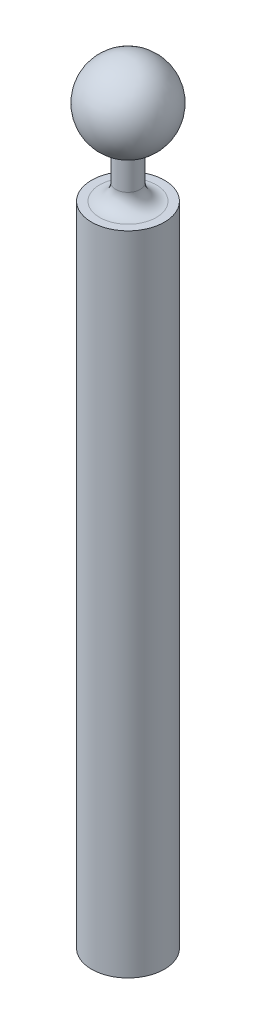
ISO-10303-21;
HEADER;
FILE_DESCRIPTION(('STEP AP214'),'2;1');
FILE_NAME('part.step','',(''),(''),'','','');
FILE_SCHEMA(('AUTOMOTIVE_DESIGN { 1 0 10303 214 1 1 1 1 }'));
ENDSEC;
DATA;
#1=APPLICATION_CONTEXT('core data for automotive mechanical design processes');
#2=APPLICATION_PROTOCOL_DEFINITION('international standard','automotive_design',2000,#1);
#3=PRODUCT_CONTEXT('',#1,'mechanical');
#4=PRODUCT('Part','Part','',(#3));
#5=PRODUCT_RELATED_PRODUCT_CATEGORY('part','',(#4));
#6=PRODUCT_DEFINITION_FORMATION('','',#4);
#7=PRODUCT_DEFINITION_CONTEXT('part definition',#1,'design');
#8=PRODUCT_DEFINITION('design','',#6,#7);
#9=PRODUCT_DEFINITION_SHAPE('','',#8);
#10=(LENGTH_UNIT() NAMED_UNIT(*) SI_UNIT(.MILLI.,.METRE.));
#11=(NAMED_UNIT(*) PLANE_ANGLE_UNIT() SI_UNIT($,.RADIAN.));
#12=(NAMED_UNIT(*) SI_UNIT($,.STERADIAN.) SOLID_ANGLE_UNIT());
#13=UNCERTAINTY_MEASURE_WITH_UNIT(LENGTH_MEASURE(1.E-05),#10,'distance_accuracy_value','');
#14=(GEOMETRIC_REPRESENTATION_CONTEXT(3) GLOBAL_UNCERTAINTY_ASSIGNED_CONTEXT((#13)) GLOBAL_UNIT_ASSIGNED_CONTEXT((#10,
#11,#12)) REPRESENTATION_CONTEXT('',''));
#15=CARTESIAN_POINT('',(0.,0.,0.));
#16=DIRECTION('',(0.,0.,1.));
#17=DIRECTION('',(1.,0.,0.));
#18=AXIS2_PLACEMENT_3D('',#15,#16,#17);
#19=CARTESIAN_POINT('',(0.,181.,0.));
#20=DIRECTION('',(0.,-1.,0.));
#21=DIRECTION('',(-1.,0.,0.));
#22=AXIS2_PLACEMENT_3D('',#19,#20,#21);
#23=SPHERICAL_SURFACE('',#22,10.);
#24=CARTESIAN_POINT('',(0.,171.,0.));
#25=VERTEX_POINT('',#24);
#26=VERTEX_LOOP('',#25);
#27=FACE_BOUND('',#26,.T.);
#28=ADVANCED_FACE('F41',(#27),#23,.T.);
#29=CLOSED_SHELL('',(#28));
#30=MANIFOLD_SOLID_BREP('B2',#29);
#31=CARTESIAN_POINT('',(0.,160.,0.));
#32=DIRECTION('',(0.,1.,0.));
#33=DIRECTION('',(0.,0.,1.));
#34=AXIS2_PLACEMENT_3D('',#31,#32,#33);
#35=PLANE('',#34);
#36=CARTESIAN_POINT('',(0.,160.,0.));
#37=DIRECTION('',(0.,1.,0.));
#38=DIRECTION('',(0.,0.,1.));
#39=AXIS2_PLACEMENT_3D('',#36,#37,#38);
#40=CIRCLE('',#39,7.);
#41=CARTESIAN_POINT('',(0.,160.,7.));
#42=VERTEX_POINT('',#41);
#43=EDGE_CURVE('E40',#42,#42,#40,.F.);
#44=ORIENTED_EDGE('',*,*,#43,.T.);
#45=EDGE_LOOP('',(#44));
#46=FACE_BOUND('',#45,.T.);
#47=CARTESIAN_POINT('',(0.,160.,0.));
#48=DIRECTION('',(0.,1.,0.));
#49=DIRECTION('',(0.,0.,1.));
#50=AXIS2_PLACEMENT_3D('',#47,#48,#49);
#51=CIRCLE('',#50,9.);
#52=CARTESIAN_POINT('',(0.,160.,9.));
#53=VERTEX_POINT('',#52);
#54=EDGE_CURVE('E67',#53,#53,#51,.T.);
#55=ORIENTED_EDGE('',*,*,#54,.T.);
#56=EDGE_LOOP('',(#55));
#57=FACE_BOUND('',#56,.T.);
#58=ADVANCED_FACE('F56',(#46,#57),#35,.T.);
#59=CARTESIAN_POINT('',(0.,160.,0.));
#60=DIRECTION('',(0.,-1.,0.));
#61=DIRECTION('',(0.,0.,-1.));
#62=AXIS2_PLACEMENT_3D('',#59,#60,#61);
#63=CYLINDRICAL_SURFACE('',#62,9.);
#64=ORIENTED_EDGE('',*,*,#54,.F.);
#65=EDGE_LOOP('',(#64));
#66=FACE_BOUND('',#65,.T.);
#67=CARTESIAN_POINT('',(0.,0.,0.));
#68=DIRECTION('',(0.,1.,0.));
#69=DIRECTION('',(0.,0.,1.));
#70=AXIS2_PLACEMENT_3D('',#67,#68,#69);
#71=CIRCLE('',#70,9.);
#72=CARTESIAN_POINT('',(0.,0.,9.));
#73=VERTEX_POINT('',#72);
#74=EDGE_CURVE('E71',#73,#73,#71,.T.);
#75=ORIENTED_EDGE('',*,*,#74,.T.);
#76=EDGE_LOOP('',(#75));
#77=FACE_BOUND('',#76,.T.);
#78=ADVANCED_FACE('F91',(#66,#77),#63,.T.);
#79=CARTESIAN_POINT('',(0.,0.,0.));
#80=DIRECTION('',(0.,1.,0.));
#81=DIRECTION('',(0.,0.,1.));
#82=AXIS2_PLACEMENT_3D('',#79,#80,#81);
#83=PLANE('',#82);
#84=ORIENTED_EDGE('',*,*,#74,.F.);
#85=EDGE_LOOP('',(#84));
#86=FACE_BOUND('',#85,.T.);
#87=ADVANCED_FACE('F84',(#86),#83,.F.);
#88=CARTESIAN_POINT('',(0.,175.,0.));
#89=DIRECTION('',(0.,-1.,0.));
#90=DIRECTION('',(0.,0.,-1.));
#91=AXIS2_PLACEMENT_3D('',#88,#89,#90);
#92=CYLINDRICAL_SURFACE('',#91,3.);
#93=CARTESIAN_POINT('',(0.,164.,0.));
#94=DIRECTION('',(0.,1.,0.));
#95=DIRECTION('',(0.,0.,1.));
#96=AXIS2_PLACEMENT_3D('',#93,#94,#95);
#97=CIRCLE('',#96,3.);
#98=CARTESIAN_POINT('',(0.,164.,3.));
#99=VERTEX_POINT('',#98);
#100=EDGE_CURVE('E63',#99,#99,#97,.T.);
#101=ORIENTED_EDGE('',*,*,#100,.T.);
#102=EDGE_LOOP('',(#101));
#103=FACE_BOUND('',#102,.T.);
#104=CARTESIAN_POINT('',(0.,175.,0.));
#105=DIRECTION('',(0.,1.,0.));
#106=DIRECTION('',(0.,0.,1.));
#107=AXIS2_PLACEMENT_3D('',#104,#105,#106);
#108=CIRCLE('',#107,3.);
#109=CARTESIAN_POINT('',(0.,175.,3.));
#110=VERTEX_POINT('',#109);
#111=EDGE_CURVE('E75',#110,#110,#108,.T.);
#112=ORIENTED_EDGE('',*,*,#111,.F.);
#113=EDGE_LOOP('',(#112));
#114=FACE_BOUND('',#113,.T.);
#115=ADVANCED_FACE('F82',(#103,#114),#92,.T.);
#116=CARTESIAN_POINT('',(0.,175.,0.));
#117=DIRECTION('',(0.,1.,0.));
#118=DIRECTION('',(0.,0.,1.));
#119=AXIS2_PLACEMENT_3D('',#116,#117,#118);
#120=PLANE('',#119);
#121=ORIENTED_EDGE('',*,*,#111,.T.);
#122=EDGE_LOOP('',(#121));
#123=FACE_BOUND('',#122,.T.);
#124=ADVANCED_FACE('F80',(#123),#120,.T.);
#125=CARTESIAN_POINT('',(0.,164.,0.));
#126=DIRECTION('',(0.,1.,0.));
#127=DIRECTION('',(0.,0.,1.));
#128=AXIS2_PLACEMENT_3D('',#125,#126,#127);
#129=TOROIDAL_SURFACE('',#128,7.,4.);
#130=ORIENTED_EDGE('',*,*,#43,.F.);
#131=EDGE_LOOP('',(#130));
#132=FACE_BOUND('',#131,.T.);
#133=ORIENTED_EDGE('',*,*,#100,.F.);
#134=EDGE_LOOP('',(#133));
#135=FACE_BOUND('',#134,.T.);
#136=ADVANCED_FACE('F58',(#132,#135),#129,.F.);
#137=CLOSED_SHELL('',(#58,#78,#87,#115,#124,#136));
#138=MANIFOLD_SOLID_BREP('B6',#137);
#139=ADVANCED_BREP_SHAPE_REPRESENTATION('',(#18,#30,#138),#14);
#140=SHAPE_DEFINITION_REPRESENTATION(#9,#139);
ENDSEC;
END-ISO-10303-21;
